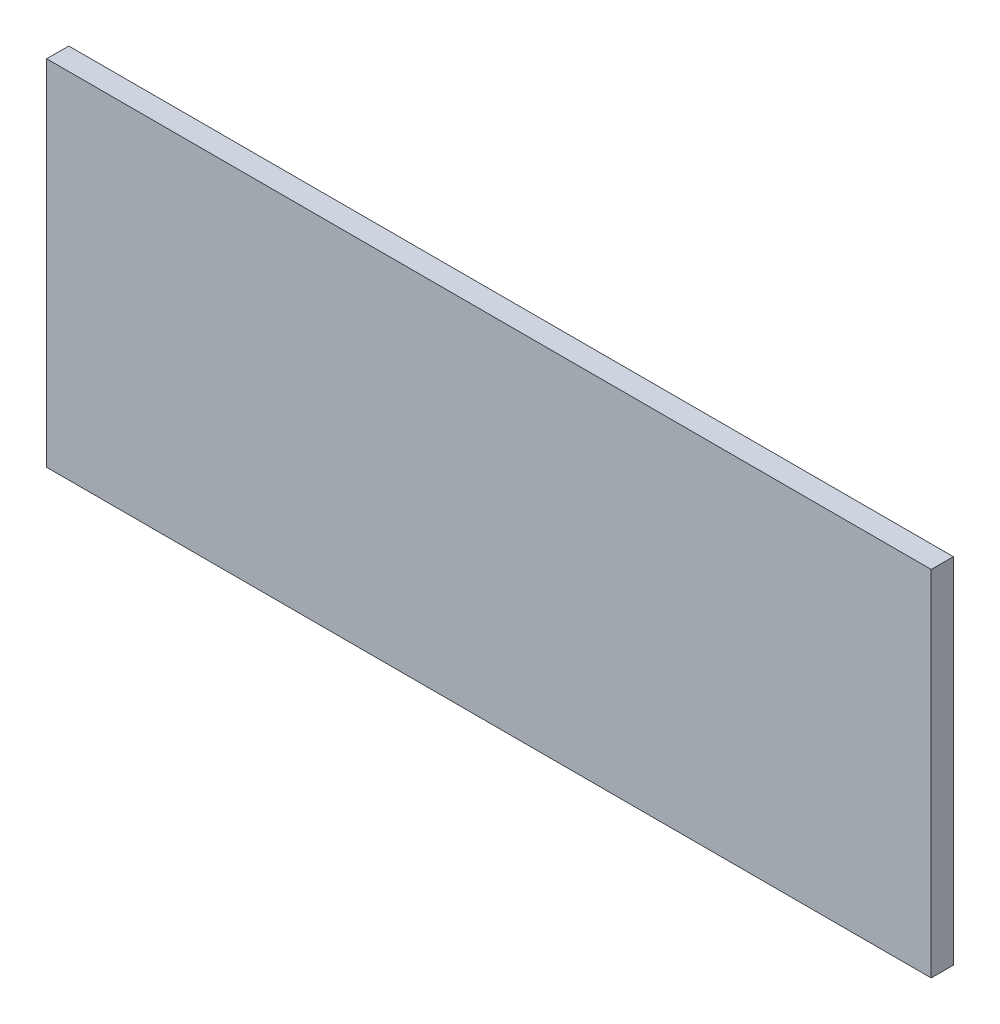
ISO-10303-21;
HEADER;
FILE_DESCRIPTION(('STEP AP214'),'2;1');
FILE_NAME('part.step','',(''),(''),'','','');
FILE_SCHEMA(('AUTOMOTIVE_DESIGN { 1 0 10303 214 1 1 1 1 }'));
ENDSEC;
DATA;
#1=APPLICATION_CONTEXT('core data for automotive mechanical design processes');
#2=APPLICATION_PROTOCOL_DEFINITION('international standard','automotive_design',2000,#1);
#3=PRODUCT_CONTEXT('',#1,'mechanical');
#4=PRODUCT('Part','Part','',(#3));
#5=PRODUCT_RELATED_PRODUCT_CATEGORY('part','',(#4));
#6=PRODUCT_DEFINITION_FORMATION('','',#4);
#7=PRODUCT_DEFINITION_CONTEXT('part definition',#1,'design');
#8=PRODUCT_DEFINITION('design','',#6,#7);
#9=PRODUCT_DEFINITION_SHAPE('','',#8);
#10=(LENGTH_UNIT() NAMED_UNIT(*) SI_UNIT(.MILLI.,.METRE.));
#11=(NAMED_UNIT(*) PLANE_ANGLE_UNIT() SI_UNIT($,.RADIAN.));
#12=(NAMED_UNIT(*) SI_UNIT($,.STERADIAN.) SOLID_ANGLE_UNIT());
#13=UNCERTAINTY_MEASURE_WITH_UNIT(LENGTH_MEASURE(1.E-05),#10,'distance_accuracy_value','');
#14=(GEOMETRIC_REPRESENTATION_CONTEXT(3) GLOBAL_UNCERTAINTY_ASSIGNED_CONTEXT((#13)) GLOBAL_UNIT_ASSIGNED_CONTEXT((#10,
#11,#12)) REPRESENTATION_CONTEXT('',''));
#15=CARTESIAN_POINT('',(0.,0.,0.));
#16=DIRECTION('',(0.,0.,1.));
#17=DIRECTION('',(1.,0.,0.));
#18=AXIS2_PLACEMENT_3D('',#15,#16,#17);
#19=CARTESIAN_POINT('',(-99.9999999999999,80.,-2.49999999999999));
#20=DIRECTION('',(1.,0.,0.));
#21=DIRECTION('',(0.,0.,-1.));
#22=AXIS2_PLACEMENT_3D('',#19,#20,#21);
#23=PLANE('',#22);
#24=DIRECTION('',(0.,0.,1.));
#25=VECTOR('',#24,1.);
#26=CARTESIAN_POINT('',(-99.9999999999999,0.,-2.49999999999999));
#27=LINE('',#26,#25);
#28=CARTESIAN_POINT('',(-99.9999999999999,0.,-2.49999999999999));
#29=VERTEX_POINT('',#28);
#30=CARTESIAN_POINT('',(-99.9999999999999,0.,2.50000000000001));
#31=VERTEX_POINT('',#30);
#32=EDGE_CURVE('E96',#29,#31,#27,.T.);
#33=ORIENTED_EDGE('',*,*,#32,.T.);
#34=DIRECTION('',(0.,-1.,0.));
#35=VECTOR('',#34,1.);
#36=CARTESIAN_POINT('',(-99.9999999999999,80.,2.50000000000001));
#37=LINE('',#36,#35);
#38=CARTESIAN_POINT('',(-99.9999999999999,80.,2.50000000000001));
#39=VERTEX_POINT('',#38);
#40=EDGE_CURVE('E11',#39,#31,#37,.T.);
#41=ORIENTED_EDGE('',*,*,#40,.F.);
#42=DIRECTION('',(0.,0.,1.));
#43=VECTOR('',#42,1.);
#44=CARTESIAN_POINT('',(-99.9999999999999,80.,-2.49999999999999));
#45=LINE('',#44,#43);
#46=CARTESIAN_POINT('',(-99.9999999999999,80.,-2.49999999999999));
#47=VERTEX_POINT('',#46);
#48=EDGE_CURVE('E84',#47,#39,#45,.T.);
#49=ORIENTED_EDGE('',*,*,#48,.F.);
#50=DIRECTION('',(0.,-1.,0.));
#51=VECTOR('',#50,1.);
#52=CARTESIAN_POINT('',(-99.9999999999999,80.,-2.49999999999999));
#53=LINE('',#52,#51);
#54=EDGE_CURVE('E92',#47,#29,#53,.T.);
#55=ORIENTED_EDGE('',*,*,#54,.T.);
#56=EDGE_LOOP('',(#33,#41,#49,#55));
#57=FACE_BOUND('',#56,.T.);
#58=ADVANCED_FACE('F33',(#57),#23,.F.);
#59=CARTESIAN_POINT('',(100.,80.,2.49999999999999));
#60=DIRECTION('',(0.,0.,-1.));
#61=DIRECTION('',(-1.,0.,0.));
#62=AXIS2_PLACEMENT_3D('',#59,#60,#61);
#63=PLANE('',#62);
#64=DIRECTION('',(1.,0.,0.));
#65=VECTOR('',#64,1.);
#66=CARTESIAN_POINT('',(100.,0.,2.49999999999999));
#67=LINE('',#66,#65);
#68=CARTESIAN_POINT('',(100.,0.,2.49999999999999));
#69=VERTEX_POINT('',#68);
#70=EDGE_CURVE('E88',#31,#69,#67,.T.);
#71=ORIENTED_EDGE('',*,*,#70,.T.);
#72=DIRECTION('',(0.,-1.,0.));
#73=VECTOR('',#72,1.);
#74=CARTESIAN_POINT('',(100.,80.,2.49999999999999));
#75=LINE('',#74,#73);
#76=CARTESIAN_POINT('',(100.,80.,2.49999999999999));
#77=VERTEX_POINT('',#76);
#78=EDGE_CURVE('E41',#77,#69,#75,.T.);
#79=ORIENTED_EDGE('',*,*,#78,.F.);
#80=DIRECTION('',(1.,0.,0.));
#81=VECTOR('',#80,1.);
#82=CARTESIAN_POINT('',(100.,80.,2.49999999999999));
#83=LINE('',#82,#81);
#84=EDGE_CURVE('E79',#39,#77,#83,.T.);
#85=ORIENTED_EDGE('',*,*,#84,.F.);
#86=ORIENTED_EDGE('',*,*,#40,.T.);
#87=EDGE_LOOP('',(#71,#79,#85,#86));
#88=FACE_BOUND('',#87,.T.);
#89=ADVANCED_FACE('F87',(#88),#63,.F.);
#90=CARTESIAN_POINT('',(100.,80.,-2.50000000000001));
#91=DIRECTION('',(-1.,0.,0.));
#92=DIRECTION('',(0.,0.,1.));
#93=AXIS2_PLACEMENT_3D('',#90,#91,#92);
#94=PLANE('',#93);
#95=DIRECTION('',(0.,0.,-1.));
#96=VECTOR('',#95,1.);
#97=CARTESIAN_POINT('',(100.,0.,-2.50000000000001));
#98=LINE('',#97,#96);
#99=CARTESIAN_POINT('',(100.,0.,-2.50000000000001));
#100=VERTEX_POINT('',#99);
#101=EDGE_CURVE('E66',#69,#100,#98,.T.);
#102=ORIENTED_EDGE('',*,*,#101,.T.);
#103=DIRECTION('',(0.,-1.,0.));
#104=VECTOR('',#103,1.);
#105=CARTESIAN_POINT('',(100.,80.,-2.50000000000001));
#106=LINE('',#105,#104);
#107=CARTESIAN_POINT('',(100.,80.,-2.50000000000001));
#108=VERTEX_POINT('',#107);
#109=EDGE_CURVE('E89',#108,#100,#106,.T.);
#110=ORIENTED_EDGE('',*,*,#109,.F.);
#111=DIRECTION('',(0.,0.,-1.));
#112=VECTOR('',#111,1.);
#113=CARTESIAN_POINT('',(100.,80.,-2.50000000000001));
#114=LINE('',#113,#112);
#115=EDGE_CURVE('E82',#77,#108,#114,.T.);
#116=ORIENTED_EDGE('',*,*,#115,.F.);
#117=ORIENTED_EDGE('',*,*,#78,.T.);
#118=EDGE_LOOP('',(#102,#110,#116,#117));
#119=FACE_BOUND('',#118,.T.);
#120=ADVANCED_FACE('F90',(#119),#94,.F.);
#121=CARTESIAN_POINT('',(100.,80.,-2.50000000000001));
#122=DIRECTION('',(0.,0.,1.));
#123=DIRECTION('',(1.,0.,0.));
#124=AXIS2_PLACEMENT_3D('',#121,#122,#123);
#125=PLANE('',#124);
#126=DIRECTION('',(-1.,0.,0.));
#127=VECTOR('',#126,1.);
#128=CARTESIAN_POINT('',(100.,0.,-2.50000000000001));
#129=LINE('',#128,#127);
#130=EDGE_CURVE('E72',#100,#29,#129,.T.);
#131=ORIENTED_EDGE('',*,*,#130,.T.);
#132=ORIENTED_EDGE('',*,*,#54,.F.);
#133=DIRECTION('',(-1.,0.,0.));
#134=VECTOR('',#133,1.);
#135=CARTESIAN_POINT('',(100.,80.,-2.50000000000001));
#136=LINE('',#135,#134);
#137=EDGE_CURVE('E49',#108,#47,#136,.T.);
#138=ORIENTED_EDGE('',*,*,#137,.F.);
#139=ORIENTED_EDGE('',*,*,#109,.T.);
#140=EDGE_LOOP('',(#131,#132,#138,#139));
#141=FACE_BOUND('',#140,.T.);
#142=ADVANCED_FACE('F103',(#141),#125,.F.);
#143=CARTESIAN_POINT('',(0.,80.,0.));
#144=DIRECTION('',(0.,-1.,0.));
#145=DIRECTION('',(0.,0.,-1.));
#146=AXIS2_PLACEMENT_3D('',#143,#144,#145);
#147=PLANE('',#146);
#148=ORIENTED_EDGE('',*,*,#48,.T.);
#149=ORIENTED_EDGE('',*,*,#84,.T.);
#150=ORIENTED_EDGE('',*,*,#115,.T.);
#151=ORIENTED_EDGE('',*,*,#137,.T.);
#152=EDGE_LOOP('',(#148,#149,#150,#151));
#153=FACE_BOUND('',#152,.T.);
#154=ADVANCED_FACE('F80',(#153),#147,.F.);
#155=CARTESIAN_POINT('',(0.,0.,0.));
#156=DIRECTION('',(0.,-1.,0.));
#157=DIRECTION('',(0.,0.,-1.));
#158=AXIS2_PLACEMENT_3D('',#155,#156,#157);
#159=PLANE('',#158);
#160=ORIENTED_EDGE('',*,*,#32,.F.);
#161=ORIENTED_EDGE('',*,*,#130,.F.);
#162=ORIENTED_EDGE('',*,*,#101,.F.);
#163=ORIENTED_EDGE('',*,*,#70,.F.);
#164=EDGE_LOOP('',(#160,#161,#162,#163));
#165=FACE_BOUND('',#164,.T.);
#166=ADVANCED_FACE('F106',(#165),#159,.T.);
#167=CLOSED_SHELL('',(#58,#89,#120,#142,#154,#166));
#168=MANIFOLD_SOLID_BREP('B2',#167);
#169=ADVANCED_BREP_SHAPE_REPRESENTATION('',(#18,#168),#14);
#170=SHAPE_DEFINITION_REPRESENTATION(#9,#169);
ENDSEC;
END-ISO-10303-21;
